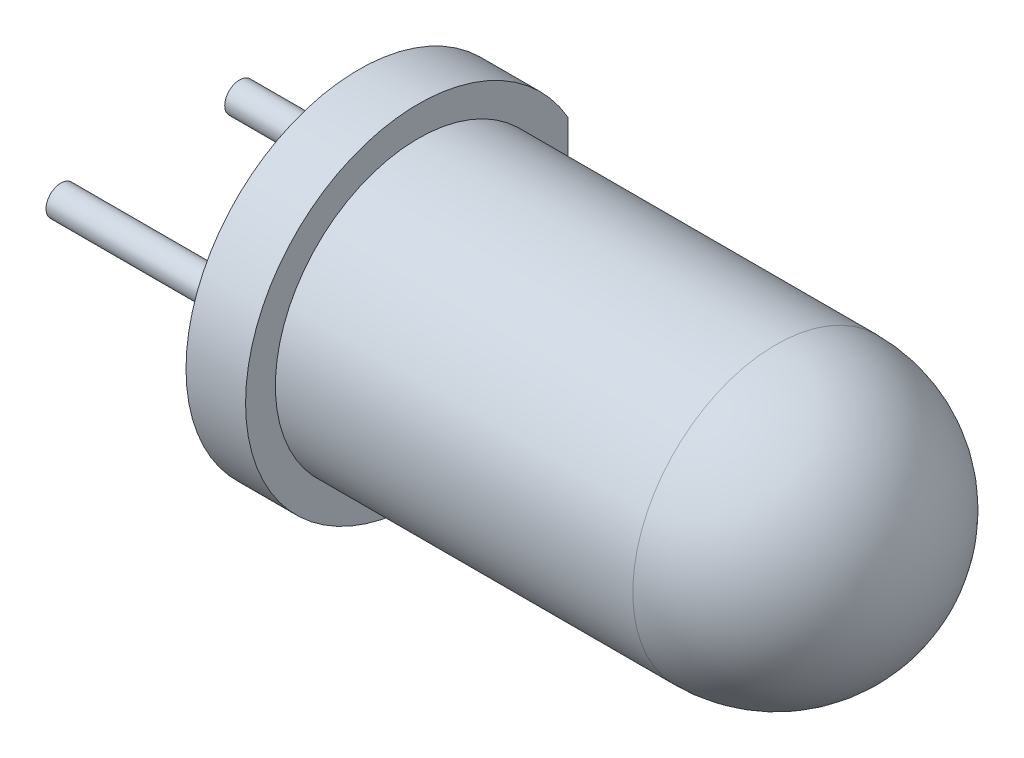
ISO-10303-21;
HEADER;
FILE_DESCRIPTION(('STEP AP214'),'2;1');
FILE_NAME('part.step','',(''),(''),'','','');
FILE_SCHEMA(('AUTOMOTIVE_DESIGN { 1 0 10303 214 1 1 1 1 }'));
ENDSEC;
DATA;
#1=APPLICATION_CONTEXT('core data for automotive mechanical design processes');
#2=APPLICATION_PROTOCOL_DEFINITION('international standard','automotive_design',2000,#1);
#3=PRODUCT_CONTEXT('',#1,'mechanical');
#4=PRODUCT('Part','Part','',(#3));
#5=PRODUCT_RELATED_PRODUCT_CATEGORY('part','',(#4));
#6=PRODUCT_DEFINITION_FORMATION('','',#4);
#7=PRODUCT_DEFINITION_CONTEXT('part definition',#1,'design');
#8=PRODUCT_DEFINITION('design','',#6,#7);
#9=PRODUCT_DEFINITION_SHAPE('','',#8);
#10=(LENGTH_UNIT() NAMED_UNIT(*) SI_UNIT(.MILLI.,.METRE.));
#11=(NAMED_UNIT(*) PLANE_ANGLE_UNIT() SI_UNIT($,.RADIAN.));
#12=(NAMED_UNIT(*) SI_UNIT($,.STERADIAN.) SOLID_ANGLE_UNIT());
#13=UNCERTAINTY_MEASURE_WITH_UNIT(LENGTH_MEASURE(1.E-05),#10,'distance_accuracy_value','');
#14=(GEOMETRIC_REPRESENTATION_CONTEXT(3) GLOBAL_UNCERTAINTY_ASSIGNED_CONTEXT((#13)) GLOBAL_UNIT_ASSIGNED_CONTEXT((#10,
#11,#12)) REPRESENTATION_CONTEXT('',''));
#15=CARTESIAN_POINT('',(0.,0.,0.));
#16=DIRECTION('',(0.,0.,1.));
#17=DIRECTION('',(1.,0.,0.));
#18=AXIS2_PLACEMENT_3D('',#15,#16,#17);
#19=CARTESIAN_POINT('',(-1.,0.,0.));
#20=DIRECTION('',(1.,0.,0.));
#21=DIRECTION('',(0.,0.,-1.));
#22=AXIS2_PLACEMENT_3D('',#19,#20,#21);
#23=PLANE('',#22);
#24=CARTESIAN_POINT('',(-1.,0.,-1.5));
#25=DIRECTION('',(1.,0.,0.));
#26=DIRECTION('',(0.,0.,-1.));
#27=AXIS2_PLACEMENT_3D('',#24,#25,#26);
#28=CIRCLE('',#27,0.25);
#29=CARTESIAN_POINT('',(-1.,0.,-1.75));
#30=VERTEX_POINT('',#29);
#31=EDGE_CURVE('E34',#30,#30,#28,.F.);
#32=ORIENTED_EDGE('',*,*,#31,.F.);
#33=EDGE_LOOP('',(#32));
#34=FACE_BOUND('',#33,.T.);
#35=CARTESIAN_POINT('',(-1.,0.,0.));
#36=DIRECTION('',(-1.,0.,0.));
#37=DIRECTION('',(0.,0.,-1.));
#38=AXIS2_PLACEMENT_3D('',#35,#36,#37);
#39=CIRCLE('',#38,2.9);
#40=CARTESIAN_POINT('',(-1.,-1.44963185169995,-2.51168618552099));
#41=VERTEX_POINT('',#40);
#42=CARTESIAN_POINT('',(-1.,1.44963185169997,-2.51168618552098));
#43=VERTEX_POINT('',#42);
#44=EDGE_CURVE('E58',#41,#43,#39,.T.);
#45=ORIENTED_EDGE('',*,*,#44,.T.);
#46=DIRECTION('',(0.,-1.,0.));
#47=VECTOR('',#46,1.);
#48=CARTESIAN_POINT('',(-1.,1.44963185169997,-2.51168618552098));
#49=LINE('',#48,#47);
#50=EDGE_CURVE('E40',#43,#41,#49,.T.);
#51=ORIENTED_EDGE('',*,*,#50,.T.);
#52=EDGE_LOOP('',(#45,#51));
#53=FACE_BOUND('',#52,.T.);
#54=CARTESIAN_POINT('',(-1.,0.,1.5));
#55=DIRECTION('',(1.,0.,0.));
#56=DIRECTION('',(0.,0.,-1.));
#57=AXIS2_PLACEMENT_3D('',#54,#55,#56);
#58=CIRCLE('',#57,0.25);
#59=CARTESIAN_POINT('',(-1.,0.,1.25));
#60=VERTEX_POINT('',#59);
#61=EDGE_CURVE('E11',#60,#60,#58,.F.);
#62=ORIENTED_EDGE('',*,*,#61,.F.);
#63=EDGE_LOOP('',(#62));
#64=FACE_BOUND('',#63,.T.);
#65=ADVANCED_FACE('F26',(#34,#53,#64),#23,.F.);
#66=CARTESIAN_POINT('',(6.,0.,0.));
#67=DIRECTION('',(-1.,0.,0.));
#68=DIRECTION('',(0.,0.,1.));
#69=AXIS2_PLACEMENT_3D('',#66,#67,#68);
#70=CYLINDRICAL_SURFACE('',#69,2.4);
#71=CARTESIAN_POINT('',(6.,0.,0.));
#72=DIRECTION('',(1.,0.,0.));
#73=DIRECTION('',(0.,0.,-1.));
#74=AXIS2_PLACEMENT_3D('',#71,#72,#73);
#75=CIRCLE('',#74,2.4);
#76=CARTESIAN_POINT('',(6.,0.,-2.4));
#77=VERTEX_POINT('',#76);
#78=EDGE_CURVE('E81',#77,#77,#75,.T.);
#79=ORIENTED_EDGE('',*,*,#78,.F.);
#80=EDGE_LOOP('',(#79));
#81=FACE_BOUND('',#80,.T.);
#82=CARTESIAN_POINT('',(0.,0.,0.));
#83=DIRECTION('',(1.,0.,0.));
#84=DIRECTION('',(0.,0.,-1.));
#85=AXIS2_PLACEMENT_3D('',#82,#83,#84);
#86=CIRCLE('',#85,2.4);
#87=CARTESIAN_POINT('',(0.,0.,-2.4));
#88=VERTEX_POINT('',#87);
#89=EDGE_CURVE('E65',#88,#88,#86,.T.);
#90=ORIENTED_EDGE('',*,*,#89,.T.);
#91=EDGE_LOOP('',(#90));
#92=FACE_BOUND('',#91,.T.);
#93=ADVANCED_FACE('F89',(#81,#92),#70,.T.);
#94=CARTESIAN_POINT('',(6.,0.,0.));
#95=DIRECTION('',(0.,0.,1.));
#96=DIRECTION('',(1.,0.,0.));
#97=AXIS2_PLACEMENT_3D('',#94,#95,#96);
#98=SPHERICAL_SURFACE('',#97,2.4);
#99=CARTESIAN_POINT('',(6.,0.,0.));
#100=DIRECTION('',(1.,0.,0.));
#101=DIRECTION('',(0.,0.,-1.));
#102=AXIS2_PLACEMENT_3D('',#99,#100,#101);
#103=SPHERICAL_SURFACE('',#102,2.4);
#104=ORIENTED_EDGE('',*,*,#78,.T.);
#105=EDGE_LOOP('',(#104));
#106=FACE_BOUND('',#105,.T.);
#107=ADVANCED_FACE('F28',(#106),#103,.T.);
#108=CARTESIAN_POINT('',(0.,0.,0.));
#109=DIRECTION('',(1.,0.,0.));
#110=DIRECTION('',(0.,0.,-1.));
#111=AXIS2_PLACEMENT_3D('',#108,#109,#110);
#112=PLANE('',#111);
#113=CARTESIAN_POINT('',(0.,0.,0.));
#114=DIRECTION('',(-1.,0.,0.));
#115=DIRECTION('',(0.,0.,-1.));
#116=AXIS2_PLACEMENT_3D('',#113,#114,#115);
#117=CIRCLE('',#116,2.9);
#118=CARTESIAN_POINT('',(0.,-1.44963185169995,-2.51168618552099));
#119=VERTEX_POINT('',#118);
#120=CARTESIAN_POINT('',(0.,1.44963185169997,-2.51168618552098));
#121=VERTEX_POINT('',#120);
#122=EDGE_CURVE('E56',#119,#121,#117,.T.);
#123=ORIENTED_EDGE('',*,*,#122,.F.);
#124=DIRECTION('',(0.,-1.,0.));
#125=VECTOR('',#124,1.);
#126=CARTESIAN_POINT('',(0.,1.44963185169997,-2.51168618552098));
#127=LINE('',#126,#125);
#128=EDGE_CURVE('E52',#121,#119,#127,.T.);
#129=ORIENTED_EDGE('',*,*,#128,.F.);
#130=EDGE_LOOP('',(#123,#129));
#131=FACE_BOUND('',#130,.T.);
#132=ORIENTED_EDGE('',*,*,#89,.F.);
#133=EDGE_LOOP('',(#132));
#134=FACE_BOUND('',#133,.T.);
#135=ADVANCED_FACE('F53',(#131,#134),#112,.T.);
#136=CARTESIAN_POINT('',(-1.,0.,0.));
#137=DIRECTION('',(1.,0.,0.));
#138=DIRECTION('',(0.,0.,-1.));
#139=AXIS2_PLACEMENT_3D('',#136,#137,#138);
#140=CYLINDRICAL_SURFACE('',#139,2.9);
#141=ORIENTED_EDGE('',*,*,#122,.T.);
#142=DIRECTION('',(1.,0.,0.));
#143=VECTOR('',#142,1.);
#144=CARTESIAN_POINT('',(-1.,1.44963185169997,-2.51168618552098));
#145=LINE('',#144,#143);
#146=EDGE_CURVE('E61',#43,#121,#145,.T.);
#147=ORIENTED_EDGE('',*,*,#146,.F.);
#148=ORIENTED_EDGE('',*,*,#44,.F.);
#149=DIRECTION('',(1.,0.,0.));
#150=VECTOR('',#149,1.);
#151=CARTESIAN_POINT('',(-1.,-1.44963185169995,-2.51168618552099));
#152=LINE('',#151,#150);
#153=EDGE_CURVE('E66',#41,#119,#152,.T.);
#154=ORIENTED_EDGE('',*,*,#153,.T.);
#155=EDGE_LOOP('',(#141,#147,#148,#154));
#156=FACE_BOUND('',#155,.T.);
#157=ADVANCED_FACE('F68',(#156),#140,.T.);
#158=CARTESIAN_POINT('',(-1.,1.44963185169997,-2.51168618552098));
#159=DIRECTION('',(0.,0.,1.));
#160=DIRECTION('',(0.,-1.,0.));
#161=AXIS2_PLACEMENT_3D('',#158,#159,#160);
#162=PLANE('',#161);
#163=ORIENTED_EDGE('',*,*,#128,.T.);
#164=ORIENTED_EDGE('',*,*,#153,.F.);
#165=ORIENTED_EDGE('',*,*,#50,.F.);
#166=ORIENTED_EDGE('',*,*,#146,.T.);
#167=EDGE_LOOP('',(#163,#164,#165,#166));
#168=FACE_BOUND('',#167,.T.);
#169=ADVANCED_FACE('F62',(#168),#162,.F.);
#170=CARTESIAN_POINT('',(-4.5,0.,-1.5));
#171=DIRECTION('',(1.,0.,0.));
#172=DIRECTION('',(0.,0.,-1.));
#173=AXIS2_PLACEMENT_3D('',#170,#171,#172);
#174=CYLINDRICAL_SURFACE('',#173,0.25);
#175=CARTESIAN_POINT('',(-4.5,0.,-1.5));
#176=DIRECTION('',(-1.,0.,0.));
#177=DIRECTION('',(0.,0.,1.));
#178=AXIS2_PLACEMENT_3D('',#175,#176,#177);
#179=CIRCLE('',#178,0.25);
#180=CARTESIAN_POINT('',(-4.5,0.,-1.25));
#181=VERTEX_POINT('',#180);
#182=EDGE_CURVE('E69',#181,#181,#179,.T.);
#183=ORIENTED_EDGE('',*,*,#182,.F.);
#184=EDGE_LOOP('',(#183));
#185=FACE_BOUND('',#184,.T.);
#186=ORIENTED_EDGE('',*,*,#31,.T.);
#187=EDGE_LOOP('',(#186));
#188=FACE_BOUND('',#187,.T.);
#189=ADVANCED_FACE('F86',(#185,#188),#174,.T.);
#190=CARTESIAN_POINT('',(-4.5,0.,-1.5));
#191=DIRECTION('',(-1.,0.,0.));
#192=DIRECTION('',(0.,0.,1.));
#193=AXIS2_PLACEMENT_3D('',#190,#191,#192);
#194=PLANE('',#193);
#195=ORIENTED_EDGE('',*,*,#182,.T.);
#196=EDGE_LOOP('',(#195));
#197=FACE_BOUND('',#196,.T.);
#198=ADVANCED_FACE('F97',(#197),#194,.T.);
#199=CARTESIAN_POINT('',(-4.5,0.,1.5));
#200=DIRECTION('',(1.,0.,0.));
#201=DIRECTION('',(0.,0.,-1.));
#202=AXIS2_PLACEMENT_3D('',#199,#200,#201);
#203=CYLINDRICAL_SURFACE('',#202,0.25);
#204=CARTESIAN_POINT('',(-4.5,0.,1.5));
#205=DIRECTION('',(-1.,0.,0.));
#206=DIRECTION('',(0.,0.,1.));
#207=AXIS2_PLACEMENT_3D('',#204,#205,#206);
#208=CIRCLE('',#207,0.25);
#209=CARTESIAN_POINT('',(-4.5,0.,1.75));
#210=VERTEX_POINT('',#209);
#211=EDGE_CURVE('E72',#210,#210,#208,.T.);
#212=ORIENTED_EDGE('',*,*,#211,.F.);
#213=EDGE_LOOP('',(#212));
#214=FACE_BOUND('',#213,.T.);
#215=ORIENTED_EDGE('',*,*,#61,.T.);
#216=EDGE_LOOP('',(#215));
#217=FACE_BOUND('',#216,.T.);
#218=ADVANCED_FACE('F94',(#214,#217),#203,.T.);
#219=CARTESIAN_POINT('',(-4.5,0.,1.5));
#220=DIRECTION('',(-1.,0.,0.));
#221=DIRECTION('',(0.,0.,1.));
#222=AXIS2_PLACEMENT_3D('',#219,#220,#221);
#223=PLANE('',#222);
#224=ORIENTED_EDGE('',*,*,#211,.T.);
#225=EDGE_LOOP('',(#224));
#226=FACE_BOUND('',#225,.T.);
#227=ADVANCED_FACE('F96',(#226),#223,.T.);
#228=CLOSED_SHELL('',(#65,#93,#107,#135,#157,#169,#189,#198,#218,#227));
#229=MANIFOLD_SOLID_BREP('B2',#228);
#230=ADVANCED_BREP_SHAPE_REPRESENTATION('',(#18,#229),#14);
#231=SHAPE_DEFINITION_REPRESENTATION(#9,#230);
ENDSEC;
END-ISO-10303-21;
